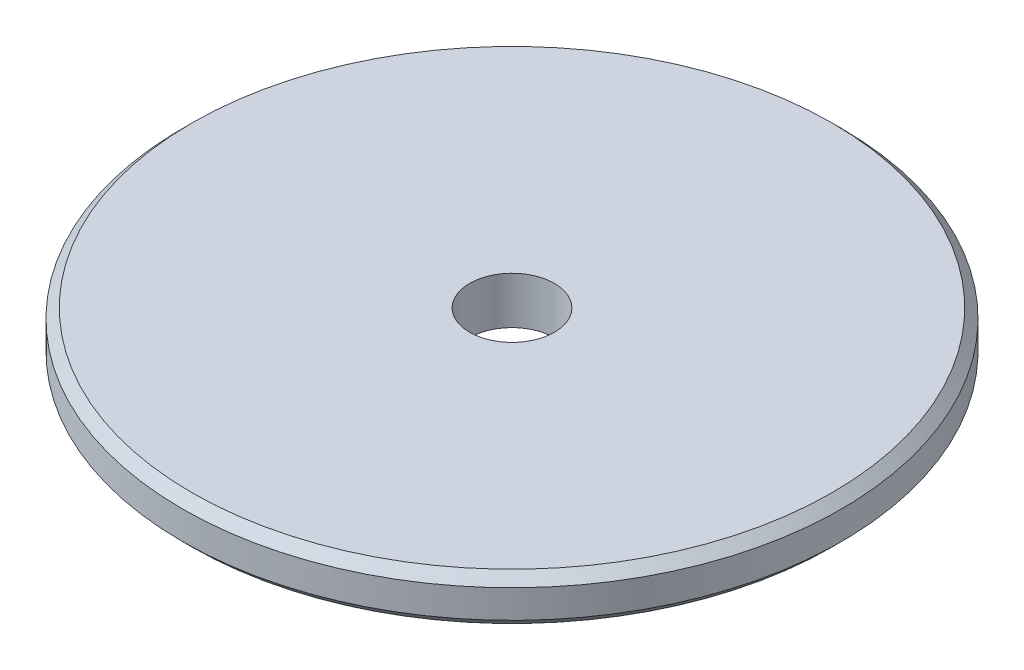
ISO-10303-21;
HEADER;
FILE_DESCRIPTION(('STEP AP214'),'2;1');
FILE_NAME('part.step','',(''),(''),'','','');
FILE_SCHEMA(('AUTOMOTIVE_DESIGN { 1 0 10303 214 1 1 1 1 }'));
ENDSEC;
DATA;
#1=APPLICATION_CONTEXT('core data for automotive mechanical design processes');
#2=APPLICATION_PROTOCOL_DEFINITION('international standard','automotive_design',2000,#1);
#3=PRODUCT_CONTEXT('',#1,'mechanical');
#4=PRODUCT('Part','Part','',(#3));
#5=PRODUCT_RELATED_PRODUCT_CATEGORY('part','',(#4));
#6=PRODUCT_DEFINITION_FORMATION('','',#4);
#7=PRODUCT_DEFINITION_CONTEXT('part definition',#1,'design');
#8=PRODUCT_DEFINITION('design','',#6,#7);
#9=PRODUCT_DEFINITION_SHAPE('','',#8);
#10=(LENGTH_UNIT() NAMED_UNIT(*) SI_UNIT(.MILLI.,.METRE.));
#11=(NAMED_UNIT(*) PLANE_ANGLE_UNIT() SI_UNIT($,.RADIAN.));
#12=(NAMED_UNIT(*) SI_UNIT($,.STERADIAN.) SOLID_ANGLE_UNIT());
#13=UNCERTAINTY_MEASURE_WITH_UNIT(LENGTH_MEASURE(1.E-05),#10,'distance_accuracy_value','');
#14=(GEOMETRIC_REPRESENTATION_CONTEXT(3) GLOBAL_UNCERTAINTY_ASSIGNED_CONTEXT((#13)) GLOBAL_UNIT_ASSIGNED_CONTEXT((#10,
#11,#12)) REPRESENTATION_CONTEXT('',''));
#15=CARTESIAN_POINT('',(0.,0.,0.));
#16=DIRECTION('',(0.,0.,1.));
#17=DIRECTION('',(1.,0.,0.));
#18=AXIS2_PLACEMENT_3D('',#15,#16,#17);
#19=CARTESIAN_POINT('',(0.,5.,0.));
#20=DIRECTION('',(0.,1.,0.));
#21=DIRECTION('',(0.,0.,1.));
#22=AXIS2_PLACEMENT_3D('',#19,#20,#21);
#23=PLANE('',#22);
#24=CARTESIAN_POINT('',(0.,5.,0.));
#25=DIRECTION('',(0.,1.,0.));
#26=DIRECTION('',(0.,0.,1.));
#27=AXIS2_PLACEMENT_3D('',#24,#25,#26);
#28=CIRCLE('',#27,34.);
#29=CARTESIAN_POINT('',(0.,5.,34.));
#30=VERTEX_POINT('',#29);
#31=EDGE_CURVE('E10',#30,#30,#28,.T.);
#32=ORIENTED_EDGE('',*,*,#31,.T.);
#33=EDGE_LOOP('',(#32));
#34=FACE_BOUND('',#33,.T.);
#35=CARTESIAN_POINT('',(0.,5.,0.));
#36=DIRECTION('',(0.,1.,0.));
#37=DIRECTION('',(0.,0.,1.));
#38=AXIS2_PLACEMENT_3D('',#35,#36,#37);
#39=CIRCLE('',#38,4.5);
#40=CARTESIAN_POINT('',(0.,5.,4.5));
#41=VERTEX_POINT('',#40);
#42=EDGE_CURVE('E49',#41,#41,#39,.T.);
#43=ORIENTED_EDGE('',*,*,#42,.F.);
#44=EDGE_LOOP('',(#43));
#45=FACE_BOUND('',#44,.T.);
#46=ADVANCED_FACE('F29',(#34,#45),#23,.T.);
#47=CARTESIAN_POINT('',(0.,0.,0.));
#48=DIRECTION('',(0.,1.,0.));
#49=DIRECTION('',(0.,0.,1.));
#50=AXIS2_PLACEMENT_3D('',#47,#48,#49);
#51=PLANE('',#50);
#52=CARTESIAN_POINT('',(0.,0.,0.));
#53=DIRECTION('',(0.,1.,0.));
#54=DIRECTION('',(0.,0.,1.));
#55=AXIS2_PLACEMENT_3D('',#52,#53,#54);
#56=CIRCLE('',#55,34.);
#57=CARTESIAN_POINT('',(0.,0.,34.));
#58=VERTEX_POINT('',#57);
#59=EDGE_CURVE('E36',#58,#58,#56,.F.);
#60=ORIENTED_EDGE('',*,*,#59,.T.);
#61=EDGE_LOOP('',(#60));
#62=FACE_BOUND('',#61,.T.);
#63=CARTESIAN_POINT('',(0.,0.,0.));
#64=DIRECTION('',(0.,1.,0.));
#65=DIRECTION('',(0.,0.,1.));
#66=AXIS2_PLACEMENT_3D('',#63,#64,#65);
#67=CIRCLE('',#66,4.5);
#68=CARTESIAN_POINT('',(0.,0.,4.5));
#69=VERTEX_POINT('',#68);
#70=EDGE_CURVE('E50',#69,#69,#67,.T.);
#71=ORIENTED_EDGE('',*,*,#70,.T.);
#72=EDGE_LOOP('',(#71));
#73=FACE_BOUND('',#72,.T.);
#74=ADVANCED_FACE('F60',(#62,#73),#51,.F.);
#75=CARTESIAN_POINT('',(0.,5.,0.));
#76=DIRECTION('',(0.,-1.,0.));
#77=DIRECTION('',(0.,0.,-1.));
#78=AXIS2_PLACEMENT_3D('',#75,#76,#77);
#79=CYLINDRICAL_SURFACE('',#78,35.);
#80=CARTESIAN_POINT('',(0.,0.999999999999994,0.));
#81=DIRECTION('',(0.,1.,0.));
#82=DIRECTION('',(0.,0.,1.));
#83=AXIS2_PLACEMENT_3D('',#80,#81,#82);
#84=CIRCLE('',#83,35.);
#85=CARTESIAN_POINT('',(0.,0.999999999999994,35.));
#86=VERTEX_POINT('',#85);
#87=EDGE_CURVE('E40',#86,#86,#84,.T.);
#88=ORIENTED_EDGE('',*,*,#87,.T.);
#89=EDGE_LOOP('',(#88));
#90=FACE_BOUND('',#89,.T.);
#91=CARTESIAN_POINT('',(0.,3.99999999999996,0.));
#92=DIRECTION('',(0.,1.,0.));
#93=DIRECTION('',(0.,0.,1.));
#94=AXIS2_PLACEMENT_3D('',#91,#92,#93);
#95=CIRCLE('',#94,35.);
#96=CARTESIAN_POINT('',(0.,3.99999999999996,35.));
#97=VERTEX_POINT('',#96);
#98=EDGE_CURVE('E44',#97,#97,#95,.F.);
#99=ORIENTED_EDGE('',*,*,#98,.T.);
#100=EDGE_LOOP('',(#99));
#101=FACE_BOUND('',#100,.T.);
#102=ADVANCED_FACE('F65',(#90,#101),#79,.T.);
#103=CARTESIAN_POINT('',(0.,5.,0.));
#104=DIRECTION('',(0.,-1.,0.));
#105=DIRECTION('',(0.,0.,-1.));
#106=AXIS2_PLACEMENT_3D('',#103,#104,#105);
#107=CYLINDRICAL_SURFACE('',#106,4.5);
#108=ORIENTED_EDGE('',*,*,#42,.T.);
#109=EDGE_LOOP('',(#108));
#110=FACE_BOUND('',#109,.T.);
#111=ORIENTED_EDGE('',*,*,#70,.F.);
#112=EDGE_LOOP('',(#111));
#113=FACE_BOUND('',#112,.T.);
#114=ADVANCED_FACE('F56',(#110,#113),#107,.F.);
#115=CARTESIAN_POINT('',(0.,0.999999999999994,0.));
#116=DIRECTION('',(0.,1.,0.));
#117=DIRECTION('',(0.,0.,1.));
#118=AXIS2_PLACEMENT_3D('',#115,#116,#117);
#119=CONICAL_SURFACE('',#118,35.,0.785398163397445);
#120=ORIENTED_EDGE('',*,*,#59,.F.);
#121=EDGE_LOOP('',(#120));
#122=FACE_BOUND('',#121,.T.);
#123=ORIENTED_EDGE('',*,*,#87,.F.);
#124=EDGE_LOOP('',(#123));
#125=FACE_BOUND('',#124,.T.);
#126=ADVANCED_FACE('F71',(#122,#125),#119,.T.);
#127=CARTESIAN_POINT('',(0.,5.,0.));
#128=DIRECTION('',(0.,-1.,0.));
#129=DIRECTION('',(0.,0.,-1.));
#130=AXIS2_PLACEMENT_3D('',#127,#128,#129);
#131=CONICAL_SURFACE('',#130,34.,0.785398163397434);
#132=ORIENTED_EDGE('',*,*,#98,.F.);
#133=EDGE_LOOP('',(#132));
#134=FACE_BOUND('',#133,.T.);
#135=ORIENTED_EDGE('',*,*,#31,.F.);
#136=EDGE_LOOP('',(#135));
#137=FACE_BOUND('',#136,.T.);
#138=ADVANCED_FACE('F31',(#134,#137),#131,.T.);
#139=CLOSED_SHELL('',(#46,#74,#102,#114,#126,#138));
#140=MANIFOLD_SOLID_BREP('B2',#139);
#141=ADVANCED_BREP_SHAPE_REPRESENTATION('',(#18,#140),#14);
#142=SHAPE_DEFINITION_REPRESENTATION(#9,#141);
ENDSEC;
END-ISO-10303-21;
